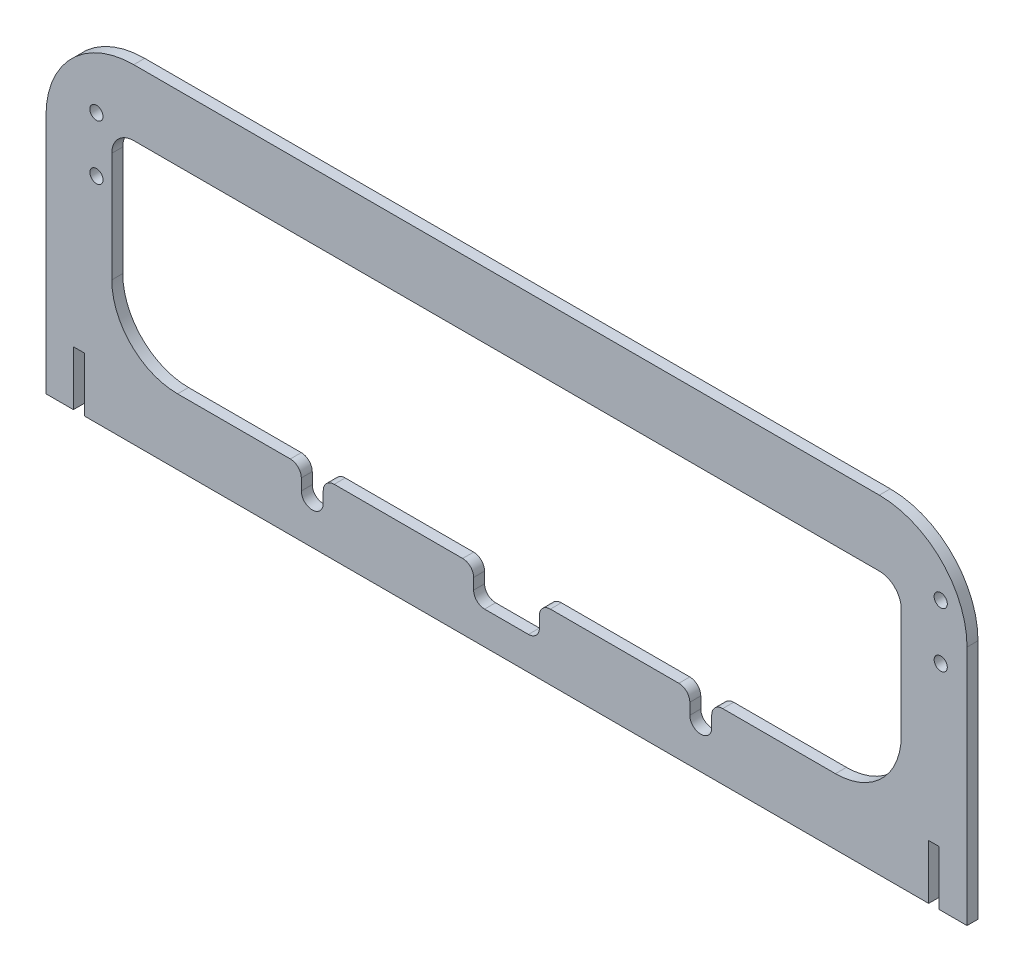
from build123d import *

# Parameters (mm, degrees)
SALIENTE_EXTRUIR1_DEPTH = 2.5
CORTAR_EXTRUIR1_DEPTH   = 10
CROQUIS3_W              = 30
CROQUIS3_H              = 30
CORTAR_EXTRUIR2_DEPTH   = 10
REDONDEO1_R             = 5
CROQUIS4_W              = 5
CROQUIS4_H              = 24.863618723
CROQUIS4_W_2            = 4.78615012
CORTAR_EXTRUIR3_DEPTH   = 5
CROQUIS5_R              = 3
CORTAR_EXTRUIR4_DEPTH   = 259.118189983


with BuildPart() as part:
    # Croquis1 → Saliente-Extruir1 (new, symmetric)
    with BuildSketch(Plane.XY):
        with BuildLine():
            Line((210, 0), (-210, 0))
            Line((-210, 0), (-210, 110))
            ThreePointArc((-210, 110), (-198.284271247, 138.284271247), (-170, 150))
            Line((-170, 150), (170, 150))
            ThreePointArc((170, 150), (198.284271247, 138.284271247), (210, 110))
            Line((210, 110), (210, 0))
        make_face()
        with BuildLine():
            Line((-180, 60), (-180, 110))
            ThreePointArc((-180, 110), (-177.071067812, 117.071067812), (-170, 120))
            Line((-170, 120), (170, 120))
            ThreePointArc((170, 120), (177.071067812, 117.071067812), (180, 110))
            Line((180, 110), (180, 60))
            ThreePointArc((180, 60), (171.213203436, 38.786796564), (150, 30))
            Line((150, 30), (-150, 30))
            ThreePointArc((-150, 30), (-171.213203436, 38.786796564), (-180, 60))
        make_face(mode=Mode.SUBTRACT)
    extrude(amount=SALIENTE_EXTRUIR1_DEPTH, both=True)

    # Croquis2 → Cortar-Extruir1 (cut)
    with BuildSketch(Plane(origin=(0, 0, -2.5), x_dir=(-1, 0, 0), z_dir=(0, 0, -1))):
        with BuildLine():
            Line((-93.580212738, 19.863618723), (-93.580212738, 39.863618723))
            Line((-93.580212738, 39.863618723), (-83.580212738, 39.863618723))
            Line((-83.580212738, 39.863618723), (-83.580212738, 19.863618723))
            ThreePointArc((-83.580212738, 19.863618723), (-88.580212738, 14.863618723), (-93.580212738, 19.863618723))
        make_face()
    cortar_extruir1 = extrude(amount=-CORTAR_EXTRUIR1_DEPTH, mode=Mode.SUBTRACT)

    # Croquis3 → Cortar-Extruir2 (cut)
    with BuildSketch(Plane.XY.offset(2.5)):
        with Locations((0, 30)):
            Rectangle(CROQUIS3_W, CROQUIS3_H)
    extrude(amount=-CORTAR_EXTRUIR2_DEPTH, mode=Mode.SUBTRACT)

    # Simetr_a1: Cortar-Extruir1 across plane
    add(cortar_extruir1.mirror(Plane(origin=(0, 0, 0), x_dir=(0, 0, 1), z_dir=(1, 0, 0))), mode=Mode.SUBTRACT)

    # Redondeo1
    redondeo1_edges = [part.edges().sort_by_distance(p)[0] for p in [
        (93.580212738, 30, 0),
        (83.580212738, 30, 0),
        (-15, 30, 0),
        (15, 30, 0),
        (-15, 15, 0),
        (15, 15, 0),
        (-83.580212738, 30, 0),
        (-93.580212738, 30, 0),
    ]]
    fillet(redondeo1_edges, radius=REDONDEO1_R)

    # Croquis4 → Cortar-Extruir3 (cut)
    with BuildSketch(Plane.XY.offset(2.5)):
        with Locations((-195, 12.431809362)):
            Rectangle(CROQUIS4_W, CROQUIS4_H)
        with Locations((194.89307506, 12.431809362)):
            Rectangle(CROQUIS4_W_2, CROQUIS4_H)
    extrude(amount=-CORTAR_EXTRUIR3_DEPTH, mode=Mode.SUBTRACT)

    # Croquis5 → Cortar-Extruir4 (cut, through all)
    with BuildSketch(Plane(origin=(0, 0, -2.5), x_dir=(-1, 0, 0), z_dir=(0, 0, -1))):
        with Locations((187, 97.5)):
            Circle(CROQUIS5_R)
        with Locations((187, 122.5)):
            Circle(CROQUIS5_R)
        with Locations((-198, 122.5)):
            Circle(CROQUIS5_R)
        with Locations((-198, 97.5)):
            Circle(CROQUIS5_R)
    extrude(amount=-CORTAR_EXTRUIR4_DEPTH, mode=Mode.SUBTRACT)


solid = part.part
